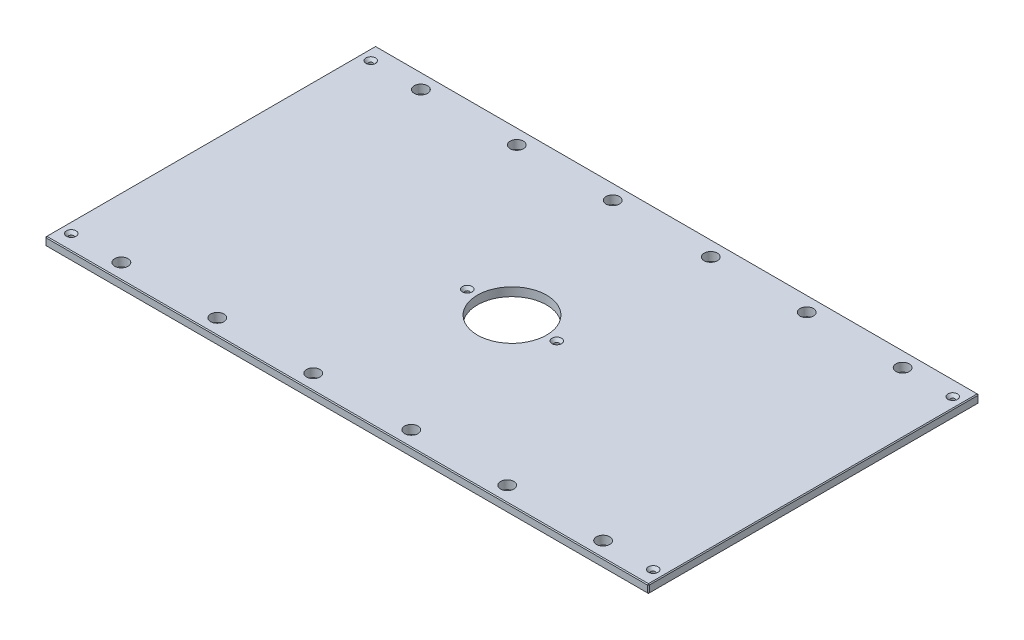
ISO-10303-21;
HEADER;
FILE_DESCRIPTION(('STEP AP214'),'2;1');
FILE_NAME('part.step','',(''),(''),'','','');
FILE_SCHEMA(('AUTOMOTIVE_DESIGN { 1 0 10303 214 1 1 1 1 }'));
ENDSEC;
DATA;
#1=APPLICATION_CONTEXT('core data for automotive mechanical design processes');
#2=APPLICATION_PROTOCOL_DEFINITION('international standard','automotive_design',2000,#1);
#3=PRODUCT_CONTEXT('',#1,'mechanical');
#4=PRODUCT('Part','Part','',(#3));
#5=PRODUCT_RELATED_PRODUCT_CATEGORY('part','',(#4));
#6=PRODUCT_DEFINITION_FORMATION('','',#4);
#7=PRODUCT_DEFINITION_CONTEXT('part definition',#1,'design');
#8=PRODUCT_DEFINITION('design','',#6,#7);
#9=PRODUCT_DEFINITION_SHAPE('','',#8);
#10=(LENGTH_UNIT() NAMED_UNIT(*) SI_UNIT(.MILLI.,.METRE.));
#11=(NAMED_UNIT(*) PLANE_ANGLE_UNIT() SI_UNIT($,.RADIAN.));
#12=(NAMED_UNIT(*) SI_UNIT($,.STERADIAN.) SOLID_ANGLE_UNIT());
#13=UNCERTAINTY_MEASURE_WITH_UNIT(LENGTH_MEASURE(1.E-05),#10,'distance_accuracy_value','');
#14=(GEOMETRIC_REPRESENTATION_CONTEXT(3) GLOBAL_UNCERTAINTY_ASSIGNED_CONTEXT((#13)) GLOBAL_UNIT_ASSIGNED_CONTEXT((#10,
#11,#12)) REPRESENTATION_CONTEXT('',''));
#15=CARTESIAN_POINT('',(0.,0.,0.));
#16=DIRECTION('',(0.,0.,1.));
#17=DIRECTION('',(1.,0.,0.));
#18=AXIS2_PLACEMENT_3D('',#15,#16,#17);
#19=CARTESIAN_POINT('',(-449.2625,12.7,-246.0625));
#20=DIRECTION('',(1.,0.,0.));
#21=DIRECTION('',(0.,0.,-1.));
#22=AXIS2_PLACEMENT_3D('',#19,#20,#21);
#23=PLANE('',#22);
#24=DIRECTION('',(0.,0.,-1.));
#25=VECTOR('',#24,1.);
#26=CARTESIAN_POINT('',(-449.2625,11.43,-246.0625));
#27=LINE('',#26,#25);
#28=CARTESIAN_POINT('',(-449.2625,11.43,244.7925));
#29=VERTEX_POINT('',#28);
#30=CARTESIAN_POINT('',(-449.2625,11.43,-244.7925));
#31=VERTEX_POINT('',#30);
#32=EDGE_CURVE('E135',#29,#31,#27,.T.);
#33=ORIENTED_EDGE('',*,*,#32,.T.);
#34=DIRECTION('',(0.,-1.,0.));
#35=VECTOR('',#34,1.);
#36=CARTESIAN_POINT('',(-449.2625,12.7,-244.7925));
#37=LINE('',#36,#35);
#38=CARTESIAN_POINT('',(-449.2625,1.26999999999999,-244.7925));
#39=VERTEX_POINT('',#38);
#40=EDGE_CURVE('E131',#31,#39,#37,.T.);
#41=ORIENTED_EDGE('',*,*,#40,.T.);
#42=DIRECTION('',(0.,0.,1.));
#43=VECTOR('',#42,1.);
#44=CARTESIAN_POINT('',(-449.2625,1.26999999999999,-246.0625));
#45=LINE('',#44,#43);
#46=CARTESIAN_POINT('',(-449.2625,1.26999999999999,244.7925));
#47=VERTEX_POINT('',#46);
#48=EDGE_CURVE('E126',#39,#47,#45,.T.);
#49=ORIENTED_EDGE('',*,*,#48,.T.);
#50=DIRECTION('',(0.,1.,0.));
#51=VECTOR('',#50,1.);
#52=CARTESIAN_POINT('',(-449.2625,12.7,244.7925));
#53=LINE('',#52,#51);
#54=EDGE_CURVE('E128',#47,#29,#53,.T.);
#55=ORIENTED_EDGE('',*,*,#54,.T.);
#56=EDGE_LOOP('',(#33,#41,#49,#55));
#57=FACE_BOUND('',#56,.T.);
#58=ADVANCED_FACE('F35',(#57),#23,.F.);
#59=CARTESIAN_POINT('',(-449.2625,12.7,246.0625));
#60=DIRECTION('',(0.,0.,-1.));
#61=DIRECTION('',(-1.,0.,0.));
#62=AXIS2_PLACEMENT_3D('',#59,#60,#61);
#63=PLANE('',#62);
#64=DIRECTION('',(1.,0.,0.));
#65=VECTOR('',#64,1.);
#66=CARTESIAN_POINT('',(-449.2625,1.2700000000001,246.0625));
#67=LINE('',#66,#65);
#68=CARTESIAN_POINT('',(-447.9925,1.2700000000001,246.0625));
#69=VERTEX_POINT('',#68);
#70=CARTESIAN_POINT('',(447.9925,1.2700000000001,246.0625));
#71=VERTEX_POINT('',#70);
#72=EDGE_CURVE('E58',#69,#71,#67,.T.);
#73=ORIENTED_EDGE('',*,*,#72,.T.);
#74=DIRECTION('',(0.,1.,0.));
#75=VECTOR('',#74,1.);
#76=CARTESIAN_POINT('',(447.9925,12.7,246.0625));
#77=LINE('',#76,#75);
#78=CARTESIAN_POINT('',(447.9925,11.4299999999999,246.0625));
#79=VERTEX_POINT('',#78);
#80=EDGE_CURVE('E11',#71,#79,#77,.T.);
#81=ORIENTED_EDGE('',*,*,#80,.T.);
#82=DIRECTION('',(-1.,0.,0.));
#83=VECTOR('',#82,1.);
#84=CARTESIAN_POINT('',(-449.2625,11.4299999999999,246.0625));
#85=LINE('',#84,#83);
#86=CARTESIAN_POINT('',(-447.9925,11.4299999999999,246.0625));
#87=VERTEX_POINT('',#86);
#88=EDGE_CURVE('E44',#79,#87,#85,.T.);
#89=ORIENTED_EDGE('',*,*,#88,.T.);
#90=DIRECTION('',(0.,-1.,0.));
#91=VECTOR('',#90,1.);
#92=CARTESIAN_POINT('',(-447.9925,12.7,246.0625));
#93=LINE('',#92,#91);
#94=EDGE_CURVE('E327',#87,#69,#93,.T.);
#95=ORIENTED_EDGE('',*,*,#94,.T.);
#96=EDGE_LOOP('',(#73,#81,#89,#95));
#97=FACE_BOUND('',#96,.T.);
#98=ADVANCED_FACE('F396',(#97),#63,.F.);
#99=CARTESIAN_POINT('',(449.2625,12.7,-246.0625));
#100=DIRECTION('',(-1.,0.,0.));
#101=DIRECTION('',(0.,0.,1.));
#102=AXIS2_PLACEMENT_3D('',#99,#100,#101);
#103=PLANE('',#102);
#104=DIRECTION('',(0.,0.,-1.));
#105=VECTOR('',#104,1.);
#106=CARTESIAN_POINT('',(449.2625,1.2700000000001,-246.0625));
#107=LINE('',#106,#105);
#108=CARTESIAN_POINT('',(449.2625,1.2700000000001,244.7925));
#109=VERTEX_POINT('',#108);
#110=CARTESIAN_POINT('',(449.2625,1.2700000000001,-244.7925));
#111=VERTEX_POINT('',#110);
#112=EDGE_CURVE('E322',#109,#111,#107,.T.);
#113=ORIENTED_EDGE('',*,*,#112,.T.);
#114=DIRECTION('',(0.,1.,0.));
#115=VECTOR('',#114,1.);
#116=CARTESIAN_POINT('',(449.2625,12.7,-244.7925));
#117=LINE('',#116,#115);
#118=CARTESIAN_POINT('',(449.2625,11.43,-244.7925));
#119=VERTEX_POINT('',#118);
#120=EDGE_CURVE('E324',#111,#119,#117,.T.);
#121=ORIENTED_EDGE('',*,*,#120,.T.);
#122=DIRECTION('',(0.,0.,1.));
#123=VECTOR('',#122,1.);
#124=CARTESIAN_POINT('',(449.2625,11.43,246.0625));
#125=LINE('',#124,#123);
#126=CARTESIAN_POINT('',(449.2625,11.43,244.7925));
#127=VERTEX_POINT('',#126);
#128=EDGE_CURVE('E320',#119,#127,#125,.T.);
#129=ORIENTED_EDGE('',*,*,#128,.T.);
#130=DIRECTION('',(0.,-1.,0.));
#131=VECTOR('',#130,1.);
#132=CARTESIAN_POINT('',(449.2625,12.7,244.7925));
#133=LINE('',#132,#131);
#134=EDGE_CURVE('E318',#127,#109,#133,.T.);
#135=ORIENTED_EDGE('',*,*,#134,.T.);
#136=EDGE_LOOP('',(#113,#121,#129,#135));
#137=FACE_BOUND('',#136,.T.);
#138=ADVANCED_FACE('F383',(#137),#103,.F.);
#139=CARTESIAN_POINT('',(-449.2625,12.7,-246.0625));
#140=DIRECTION('',(0.,0.,1.));
#141=DIRECTION('',(1.,0.,0.));
#142=AXIS2_PLACEMENT_3D('',#139,#140,#141);
#143=PLANE('',#142);
#144=DIRECTION('',(-1.,0.,0.));
#145=VECTOR('',#144,1.);
#146=CARTESIAN_POINT('',(-449.2625,1.2700000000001,-246.0625));
#147=LINE('',#146,#145);
#148=CARTESIAN_POINT('',(447.9925,1.2700000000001,-246.0625));
#149=VERTEX_POINT('',#148);
#150=CARTESIAN_POINT('',(-447.9925,1.2700000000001,-246.0625));
#151=VERTEX_POINT('',#150);
#152=EDGE_CURVE('E294',#149,#151,#147,.T.);
#153=ORIENTED_EDGE('',*,*,#152,.T.);
#154=DIRECTION('',(0.,1.,0.));
#155=VECTOR('',#154,1.);
#156=CARTESIAN_POINT('',(-447.9925,12.7,-246.0625));
#157=LINE('',#156,#155);
#158=CARTESIAN_POINT('',(-447.9925,11.43,-246.0625));
#159=VERTEX_POINT('',#158);
#160=EDGE_CURVE('E298',#151,#159,#157,.T.);
#161=ORIENTED_EDGE('',*,*,#160,.T.);
#162=DIRECTION('',(1.,0.,0.));
#163=VECTOR('',#162,1.);
#164=CARTESIAN_POINT('',(449.2625,11.43,-246.0625));
#165=LINE('',#164,#163);
#166=CARTESIAN_POINT('',(447.9925,11.43,-246.0625));
#167=VERTEX_POINT('',#166);
#168=EDGE_CURVE('E296',#159,#167,#165,.T.);
#169=ORIENTED_EDGE('',*,*,#168,.T.);
#170=DIRECTION('',(0.,-1.,0.));
#171=VECTOR('',#170,1.);
#172=CARTESIAN_POINT('',(447.9925,12.7,-246.0625));
#173=LINE('',#172,#171);
#174=EDGE_CURVE('E292',#167,#149,#173,.T.);
#175=ORIENTED_EDGE('',*,*,#174,.T.);
#176=EDGE_LOOP('',(#153,#161,#169,#175));
#177=FACE_BOUND('',#176,.T.);
#178=ADVANCED_FACE('F357',(#177),#143,.F.);
#179=CARTESIAN_POINT('',(0.,12.7,0.));
#180=DIRECTION('',(0.,1.,0.));
#181=DIRECTION('',(0.,0.,1.));
#182=AXIS2_PLACEMENT_3D('',#179,#180,#181);
#183=PLANE('',#182);
#184=CARTESIAN_POINT('',(433.3875,12.7,-223.04248));
#185=DIRECTION('',(0.,1.,0.));
#186=DIRECTION('',(0.,0.,1.));
#187=AXIS2_PLACEMENT_3D('',#184,#185,#186);
#188=CIRCLE('',#187,7.13740000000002);
#189=CARTESIAN_POINT('',(433.3875,12.7,-215.90508));
#190=VERTEX_POINT('',#189);
#191=EDGE_CURVE('E880',#190,#190,#188,.T.);
#192=ORIENTED_EDGE('',*,*,#191,.F.);
#193=EDGE_LOOP('',(#192));
#194=FACE_BOUND('',#193,.T.);
#195=CARTESIAN_POINT('',(433.3875,12.7,223.04248));
#196=DIRECTION('',(0.,1.,0.));
#197=DIRECTION('',(0.,0.,1.));
#198=AXIS2_PLACEMENT_3D('',#195,#196,#197);
#199=CIRCLE('',#198,7.13740000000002);
#200=CARTESIAN_POINT('',(433.3875,12.7,230.17988));
#201=VERTEX_POINT('',#200);
#202=EDGE_CURVE('E884',#201,#201,#199,.T.);
#203=ORIENTED_EDGE('',*,*,#202,.F.);
#204=EDGE_LOOP('',(#203));
#205=FACE_BOUND('',#204,.T.);
#206=CARTESIAN_POINT('',(-433.3875,12.7,223.04248));
#207=DIRECTION('',(0.,1.,0.));
#208=DIRECTION('',(0.,0.,1.));
#209=AXIS2_PLACEMENT_3D('',#206,#207,#208);
#210=CIRCLE('',#209,7.13740000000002);
#211=CARTESIAN_POINT('',(-433.3875,12.7,230.17988));
#212=VERTEX_POINT('',#211);
#213=EDGE_CURVE('E888',#212,#212,#210,.T.);
#214=ORIENTED_EDGE('',*,*,#213,.F.);
#215=EDGE_LOOP('',(#214));
#216=FACE_BOUND('',#215,.T.);
#217=CARTESIAN_POINT('',(-66.675,12.7,0.));
#218=DIRECTION('',(0.,1.,0.));
#219=DIRECTION('',(0.,0.,1.));
#220=AXIS2_PLACEMENT_3D('',#217,#218,#219);
#221=CIRCLE('',#220,7.1374);
#222=CARTESIAN_POINT('',(-66.675,12.7,7.1374));
#223=VERTEX_POINT('',#222);
#224=EDGE_CURVE('E892',#223,#223,#221,.T.);
#225=ORIENTED_EDGE('',*,*,#224,.F.);
#226=EDGE_LOOP('',(#225));
#227=FACE_BOUND('',#226,.T.);
#228=CARTESIAN_POINT('',(66.675,12.7,0.));
#229=DIRECTION('',(0.,1.,0.));
#230=DIRECTION('',(0.,0.,1.));
#231=AXIS2_PLACEMENT_3D('',#228,#229,#230);
#232=CIRCLE('',#231,7.1374);
#233=CARTESIAN_POINT('',(66.675,12.7,7.1374));
#234=VERTEX_POINT('',#233);
#235=EDGE_CURVE('E896',#234,#234,#232,.T.);
#236=ORIENTED_EDGE('',*,*,#235,.F.);
#237=EDGE_LOOP('',(#236));
#238=FACE_BOUND('',#237,.T.);
#239=CARTESIAN_POINT('',(-433.3875,12.7,-223.04248));
#240=DIRECTION('',(0.,1.,0.));
#241=DIRECTION('',(0.,0.,1.));
#242=AXIS2_PLACEMENT_3D('',#239,#240,#241);
#243=CIRCLE('',#242,7.13740000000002);
#244=CARTESIAN_POINT('',(-433.3875,12.7,-215.90508));
#245=VERTEX_POINT('',#244);
#246=EDGE_CURVE('E899',#245,#245,#243,.T.);
#247=ORIENTED_EDGE('',*,*,#246,.F.);
#248=EDGE_LOOP('',(#247));
#249=FACE_BOUND('',#248,.T.);
#250=DIRECTION('',(0.,0.,-1.));
#251=VECTOR('',#250,1.);
#252=CARTESIAN_POINT('',(447.9925,12.7,-246.0625));
#253=LINE('',#252,#251);
#254=CARTESIAN_POINT('',(447.9925,12.7,244.7925));
#255=VERTEX_POINT('',#254);
#256=CARTESIAN_POINT('',(447.9925,12.7,-244.7925));
#257=VERTEX_POINT('',#256);
#258=EDGE_CURVE('E305',#255,#257,#253,.T.);
#259=ORIENTED_EDGE('',*,*,#258,.T.);
#260=DIRECTION('',(-1.,0.,0.));
#261=VECTOR('',#260,1.);
#262=CARTESIAN_POINT('',(-449.2625,12.7,-244.7925));
#263=LINE('',#262,#261);
#264=CARTESIAN_POINT('',(-447.9925,12.7,-244.7925));
#265=VERTEX_POINT('',#264);
#266=EDGE_CURVE('E307',#257,#265,#263,.T.);
#267=ORIENTED_EDGE('',*,*,#266,.T.);
#268=DIRECTION('',(0.,0.,1.));
#269=VECTOR('',#268,1.);
#270=CARTESIAN_POINT('',(-447.9925,12.7,246.0625));
#271=LINE('',#270,#269);
#272=CARTESIAN_POINT('',(-447.9925,12.7,244.7925));
#273=VERTEX_POINT('',#272);
#274=EDGE_CURVE('E303',#265,#273,#271,.T.);
#275=ORIENTED_EDGE('',*,*,#274,.T.);
#276=DIRECTION('',(1.,0.,0.));
#277=VECTOR('',#276,1.);
#278=CARTESIAN_POINT('',(449.2625,12.7,244.7925));
#279=LINE('',#278,#277);
#280=EDGE_CURVE('E301',#273,#255,#279,.T.);
#281=ORIENTED_EDGE('',*,*,#280,.T.);
#282=EDGE_LOOP('',(#259,#267,#275,#281));
#283=FACE_BOUND('',#282,.T.);
#284=CARTESIAN_POINT('',(358.775,12.7,-223.04248));
#285=DIRECTION('',(0.,1.,0.));
#286=DIRECTION('',(0.,0.,1.));
#287=AXIS2_PLACEMENT_3D('',#284,#285,#286);
#288=CIRCLE('',#287,9.92187500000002);
#289=CARTESIAN_POINT('',(358.775,12.7,-213.120605));
#290=VERTEX_POINT('',#289);
#291=EDGE_CURVE('E204',#290,#290,#288,.T.);
#292=ORIENTED_EDGE('',*,*,#291,.F.);
#293=EDGE_LOOP('',(#292));
#294=FACE_BOUND('',#293,.T.);
#295=CARTESIAN_POINT('',(-358.775,12.7,-223.04248));
#296=DIRECTION('',(0.,1.,0.));
#297=DIRECTION('',(0.,0.,1.));
#298=AXIS2_PLACEMENT_3D('',#295,#296,#297);
#299=CIRCLE('',#298,9.92187500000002);
#300=CARTESIAN_POINT('',(-358.775,12.7,-213.120605));
#301=VERTEX_POINT('',#300);
#302=EDGE_CURVE('E214',#301,#301,#299,.T.);
#303=ORIENTED_EDGE('',*,*,#302,.F.);
#304=EDGE_LOOP('',(#303));
#305=FACE_BOUND('',#304,.T.);
#306=CARTESIAN_POINT('',(358.775,12.7,223.04248));
#307=DIRECTION('',(0.,1.,0.));
#308=DIRECTION('',(0.,0.,1.));
#309=AXIS2_PLACEMENT_3D('',#306,#307,#308);
#310=CIRCLE('',#309,9.92187500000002);
#311=CARTESIAN_POINT('',(358.775,12.7,232.964355));
#312=VERTEX_POINT('',#311);
#313=EDGE_CURVE('E225',#312,#312,#310,.T.);
#314=ORIENTED_EDGE('',*,*,#313,.F.);
#315=EDGE_LOOP('',(#314));
#316=FACE_BOUND('',#315,.T.);
#317=CARTESIAN_POINT('',(-358.775,12.7,223.04248));
#318=DIRECTION('',(0.,1.,0.));
#319=DIRECTION('',(0.,0.,1.));
#320=AXIS2_PLACEMENT_3D('',#317,#318,#319);
#321=CIRCLE('',#320,9.92187500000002);
#322=CARTESIAN_POINT('',(-358.775,12.7,232.964355));
#323=VERTEX_POINT('',#322);
#324=EDGE_CURVE('E231',#323,#323,#321,.T.);
#325=ORIENTED_EDGE('',*,*,#324,.F.);
#326=EDGE_LOOP('',(#325));
#327=FACE_BOUND('',#326,.T.);
#328=CARTESIAN_POINT('',(-215.9,12.7,-223.04248));
#329=DIRECTION('',(0.,1.,0.));
#330=DIRECTION('',(0.,0.,1.));
#331=AXIS2_PLACEMENT_3D('',#328,#329,#330);
#332=CIRCLE('',#331,9.921875);
#333=CARTESIAN_POINT('',(-215.9,12.7,-213.120605));
#334=VERTEX_POINT('',#333);
#335=EDGE_CURVE('E237',#334,#334,#332,.T.);
#336=ORIENTED_EDGE('',*,*,#335,.F.);
#337=EDGE_LOOP('',(#336));
#338=FACE_BOUND('',#337,.T.);
#339=CARTESIAN_POINT('',(215.9,12.7,-223.04248));
#340=DIRECTION('',(0.,1.,0.));
#341=DIRECTION('',(0.,0.,1.));
#342=AXIS2_PLACEMENT_3D('',#339,#340,#341);
#343=CIRCLE('',#342,9.921875);
#344=CARTESIAN_POINT('',(215.9,12.7,-213.120605));
#345=VERTEX_POINT('',#344);
#346=EDGE_CURVE('E243',#345,#345,#343,.T.);
#347=ORIENTED_EDGE('',*,*,#346,.F.);
#348=EDGE_LOOP('',(#347));
#349=FACE_BOUND('',#348,.T.);
#350=CARTESIAN_POINT('',(215.9,12.7,223.04248));
#351=DIRECTION('',(0.,1.,0.));
#352=DIRECTION('',(0.,0.,1.));
#353=AXIS2_PLACEMENT_3D('',#350,#351,#352);
#354=CIRCLE('',#353,9.921875);
#355=CARTESIAN_POINT('',(215.9,12.7,232.964355));
#356=VERTEX_POINT('',#355);
#357=EDGE_CURVE('E249',#356,#356,#354,.T.);
#358=ORIENTED_EDGE('',*,*,#357,.F.);
#359=EDGE_LOOP('',(#358));
#360=FACE_BOUND('',#359,.T.);
#361=CARTESIAN_POINT('',(-215.9,12.7,223.04248));
#362=DIRECTION('',(0.,1.,0.));
#363=DIRECTION('',(0.,0.,1.));
#364=AXIS2_PLACEMENT_3D('',#361,#362,#363);
#365=CIRCLE('',#364,9.921875);
#366=CARTESIAN_POINT('',(-215.9,12.7,232.964355));
#367=VERTEX_POINT('',#366);
#368=EDGE_CURVE('E255',#367,#367,#365,.T.);
#369=ORIENTED_EDGE('',*,*,#368,.F.);
#370=EDGE_LOOP('',(#369));
#371=FACE_BOUND('',#370,.T.);
#372=CARTESIAN_POINT('',(73.025,12.7,-223.04248));
#373=DIRECTION('',(0.,1.,0.));
#374=DIRECTION('',(0.,0.,1.));
#375=AXIS2_PLACEMENT_3D('',#372,#373,#374);
#376=CIRCLE('',#375,9.921875);
#377=CARTESIAN_POINT('',(73.025,12.7,-213.120605));
#378=VERTEX_POINT('',#377);
#379=EDGE_CURVE('E261',#378,#378,#376,.T.);
#380=ORIENTED_EDGE('',*,*,#379,.F.);
#381=EDGE_LOOP('',(#380));
#382=FACE_BOUND('',#381,.T.);
#383=CARTESIAN_POINT('',(-73.025,12.7,-223.04248));
#384=DIRECTION('',(0.,1.,0.));
#385=DIRECTION('',(0.,0.,1.));
#386=AXIS2_PLACEMENT_3D('',#383,#384,#385);
#387=CIRCLE('',#386,9.921875);
#388=CARTESIAN_POINT('',(-73.025,12.7,-213.120605));
#389=VERTEX_POINT('',#388);
#390=EDGE_CURVE('E267',#389,#389,#387,.T.);
#391=ORIENTED_EDGE('',*,*,#390,.F.);
#392=EDGE_LOOP('',(#391));
#393=FACE_BOUND('',#392,.T.);
#394=CARTESIAN_POINT('',(-73.025,12.7,223.04248));
#395=DIRECTION('',(0.,1.,0.));
#396=DIRECTION('',(0.,0.,1.));
#397=AXIS2_PLACEMENT_3D('',#394,#395,#396);
#398=CIRCLE('',#397,9.921875);
#399=CARTESIAN_POINT('',(-73.025,12.7,232.964355));
#400=VERTEX_POINT('',#399);
#401=EDGE_CURVE('E273',#400,#400,#398,.T.);
#402=ORIENTED_EDGE('',*,*,#401,.F.);
#403=EDGE_LOOP('',(#402));
#404=FACE_BOUND('',#403,.T.);
#405=CARTESIAN_POINT('',(73.025,12.7,223.04248));
#406=DIRECTION('',(0.,1.,0.));
#407=DIRECTION('',(0.,0.,1.));
#408=AXIS2_PLACEMENT_3D('',#405,#406,#407);
#409=CIRCLE('',#408,9.921875);
#410=CARTESIAN_POINT('',(73.025,12.7,232.964355));
#411=VERTEX_POINT('',#410);
#412=EDGE_CURVE('E279',#411,#411,#409,.T.);
#413=ORIENTED_EDGE('',*,*,#412,.F.);
#414=EDGE_LOOP('',(#413));
#415=FACE_BOUND('',#414,.T.);
#416=CARTESIAN_POINT('',(0.,12.7,0.));
#417=DIRECTION('',(0.,1.,0.));
#418=DIRECTION('',(0.,0.,1.));
#419=AXIS2_PLACEMENT_3D('',#416,#417,#418);
#420=CIRCLE('',#419,51.562);
#421=CARTESIAN_POINT('',(0.,12.7,51.562));
#422=VERTEX_POINT('',#421);
#423=EDGE_CURVE('E285',#422,#422,#420,.T.);
#424=ORIENTED_EDGE('',*,*,#423,.F.);
#425=EDGE_LOOP('',(#424));
#426=FACE_BOUND('',#425,.T.);
#427=ADVANCED_FACE('F405',(#194,#205,#216,#227,#238,#249,#283,#294,#305,#316,#327,#338,#349,
#360,#371,#382,#393,#404,#415,#426),#183,.T.);
#428=CARTESIAN_POINT('',(0.,0.,0.));
#429=DIRECTION('',(0.,1.,0.));
#430=DIRECTION('',(0.,0.,1.));
#431=AXIS2_PLACEMENT_3D('',#428,#429,#430);
#432=PLANE('',#431);
#433=CARTESIAN_POINT('',(433.3875,0.,-223.04248));
#434=DIRECTION('',(0.,1.,0.));
#435=DIRECTION('',(0.,0.,1.));
#436=AXIS2_PLACEMENT_3D('',#433,#434,#435);
#437=CIRCLE('',#436,3.3782);
#438=CARTESIAN_POINT('',(433.3875,0.,-219.66428));
#439=VERTEX_POINT('',#438);
#440=EDGE_CURVE('E933',#439,#439,#437,.T.);
#441=ORIENTED_EDGE('',*,*,#440,.T.);
#442=EDGE_LOOP('',(#441));
#443=FACE_BOUND('',#442,.T.);
#444=CARTESIAN_POINT('',(433.3875,0.,223.04248));
#445=DIRECTION('',(0.,1.,0.));
#446=DIRECTION('',(0.,0.,1.));
#447=AXIS2_PLACEMENT_3D('',#444,#445,#446);
#448=CIRCLE('',#447,3.3782);
#449=CARTESIAN_POINT('',(433.3875,0.,226.42068));
#450=VERTEX_POINT('',#449);
#451=EDGE_CURVE('E926',#450,#450,#448,.T.);
#452=ORIENTED_EDGE('',*,*,#451,.T.);
#453=EDGE_LOOP('',(#452));
#454=FACE_BOUND('',#453,.T.);
#455=CARTESIAN_POINT('',(-433.3875,0.,223.04248));
#456=DIRECTION('',(0.,1.,0.));
#457=DIRECTION('',(0.,0.,1.));
#458=AXIS2_PLACEMENT_3D('',#455,#456,#457);
#459=CIRCLE('',#458,3.3782);
#460=CARTESIAN_POINT('',(-433.3875,0.,226.42068));
#461=VERTEX_POINT('',#460);
#462=EDGE_CURVE('E919',#461,#461,#459,.T.);
#463=ORIENTED_EDGE('',*,*,#462,.T.);
#464=EDGE_LOOP('',(#463));
#465=FACE_BOUND('',#464,.T.);
#466=CARTESIAN_POINT('',(-66.675,0.,0.));
#467=DIRECTION('',(0.,1.,0.));
#468=DIRECTION('',(0.,0.,1.));
#469=AXIS2_PLACEMENT_3D('',#466,#467,#468);
#470=CIRCLE('',#469,3.3782);
#471=CARTESIAN_POINT('',(-66.675,0.,3.3782));
#472=VERTEX_POINT('',#471);
#473=EDGE_CURVE('E912',#472,#472,#470,.T.);
#474=ORIENTED_EDGE('',*,*,#473,.T.);
#475=EDGE_LOOP('',(#474));
#476=FACE_BOUND('',#475,.T.);
#477=CARTESIAN_POINT('',(66.675,0.,0.));
#478=DIRECTION('',(0.,1.,0.));
#479=DIRECTION('',(0.,0.,1.));
#480=AXIS2_PLACEMENT_3D('',#477,#478,#479);
#481=CIRCLE('',#480,3.3782);
#482=CARTESIAN_POINT('',(66.675,0.,3.3782));
#483=VERTEX_POINT('',#482);
#484=EDGE_CURVE('E902',#483,#483,#481,.T.);
#485=ORIENTED_EDGE('',*,*,#484,.T.);
#486=EDGE_LOOP('',(#485));
#487=FACE_BOUND('',#486,.T.);
#488=CARTESIAN_POINT('',(-433.3875,0.,-223.04248));
#489=DIRECTION('',(0.,1.,0.));
#490=DIRECTION('',(0.,0.,1.));
#491=AXIS2_PLACEMENT_3D('',#488,#489,#490);
#492=CIRCLE('',#491,3.3782);
#493=CARTESIAN_POINT('',(-433.3875,0.,-219.66428));
#494=VERTEX_POINT('',#493);
#495=EDGE_CURVE('E217',#494,#494,#492,.T.);
#496=ORIENTED_EDGE('',*,*,#495,.T.);
#497=EDGE_LOOP('',(#496));
#498=FACE_BOUND('',#497,.T.);
#499=DIRECTION('',(0.,0.,-1.));
#500=VECTOR('',#499,1.);
#501=CARTESIAN_POINT('',(-447.9925,0.,0.));
#502=LINE('',#501,#500);
#503=CARTESIAN_POINT('',(-447.9925,0.,244.7925));
#504=VERTEX_POINT('',#503);
#505=CARTESIAN_POINT('',(-447.9925,0.,-244.7925));
#506=VERTEX_POINT('',#505);
#507=EDGE_CURVE('E158',#504,#506,#502,.T.);
#508=ORIENTED_EDGE('',*,*,#507,.T.);
#509=DIRECTION('',(1.,0.,0.));
#510=VECTOR('',#509,1.);
#511=CARTESIAN_POINT('',(0.,0.,-244.7925));
#512=LINE('',#511,#510);
#513=CARTESIAN_POINT('',(447.9925,0.,-244.7925));
#514=VERTEX_POINT('',#513);
#515=EDGE_CURVE('E315',#506,#514,#512,.T.);
#516=ORIENTED_EDGE('',*,*,#515,.T.);
#517=DIRECTION('',(0.,0.,1.));
#518=VECTOR('',#517,1.);
#519=CARTESIAN_POINT('',(447.9925,0.,0.));
#520=LINE('',#519,#518);
#521=CARTESIAN_POINT('',(447.9925,0.,244.7925));
#522=VERTEX_POINT('',#521);
#523=EDGE_CURVE('E313',#514,#522,#520,.T.);
#524=ORIENTED_EDGE('',*,*,#523,.T.);
#525=DIRECTION('',(-1.,0.,0.));
#526=VECTOR('',#525,1.);
#527=CARTESIAN_POINT('',(0.,0.,244.7925));
#528=LINE('',#527,#526);
#529=EDGE_CURVE('E310',#522,#504,#528,.T.);
#530=ORIENTED_EDGE('',*,*,#529,.T.);
#531=EDGE_LOOP('',(#508,#516,#524,#530));
#532=FACE_BOUND('',#531,.T.);
#533=CARTESIAN_POINT('',(358.775,0.,-223.04248));
#534=DIRECTION('',(0.,1.,0.));
#535=DIRECTION('',(0.,0.,1.));
#536=AXIS2_PLACEMENT_3D('',#533,#534,#535);
#537=CIRCLE('',#536,9.92187500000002);
#538=CARTESIAN_POINT('',(358.775,0.,-213.120605));
#539=VERTEX_POINT('',#538);
#540=EDGE_CURVE('E209',#539,#539,#537,.T.);
#541=ORIENTED_EDGE('',*,*,#540,.T.);
#542=EDGE_LOOP('',(#541));
#543=FACE_BOUND('',#542,.T.);
#544=CARTESIAN_POINT('',(-358.775,0.,-223.04248));
#545=DIRECTION('',(0.,1.,0.));
#546=DIRECTION('',(0.,0.,1.));
#547=AXIS2_PLACEMENT_3D('',#544,#545,#546);
#548=CIRCLE('',#547,9.92187500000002);
#549=CARTESIAN_POINT('',(-358.775,0.,-213.120605));
#550=VERTEX_POINT('',#549);
#551=EDGE_CURVE('E222',#550,#550,#548,.T.);
#552=ORIENTED_EDGE('',*,*,#551,.T.);
#553=EDGE_LOOP('',(#552));
#554=FACE_BOUND('',#553,.T.);
#555=CARTESIAN_POINT('',(358.775,0.,223.04248));
#556=DIRECTION('',(0.,1.,0.));
#557=DIRECTION('',(0.,0.,1.));
#558=AXIS2_PLACEMENT_3D('',#555,#556,#557);
#559=CIRCLE('',#558,9.92187500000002);
#560=CARTESIAN_POINT('',(358.775,0.,232.964355));
#561=VERTEX_POINT('',#560);
#562=EDGE_CURVE('E228',#561,#561,#559,.T.);
#563=ORIENTED_EDGE('',*,*,#562,.T.);
#564=EDGE_LOOP('',(#563));
#565=FACE_BOUND('',#564,.T.);
#566=CARTESIAN_POINT('',(-358.775,0.,223.04248));
#567=DIRECTION('',(0.,1.,0.));
#568=DIRECTION('',(0.,0.,1.));
#569=AXIS2_PLACEMENT_3D('',#566,#567,#568);
#570=CIRCLE('',#569,9.92187500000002);
#571=CARTESIAN_POINT('',(-358.775,0.,232.964355));
#572=VERTEX_POINT('',#571);
#573=EDGE_CURVE('E234',#572,#572,#570,.T.);
#574=ORIENTED_EDGE('',*,*,#573,.T.);
#575=EDGE_LOOP('',(#574));
#576=FACE_BOUND('',#575,.T.);
#577=CARTESIAN_POINT('',(-215.9,0.,-223.04248));
#578=DIRECTION('',(0.,1.,0.));
#579=DIRECTION('',(0.,0.,1.));
#580=AXIS2_PLACEMENT_3D('',#577,#578,#579);
#581=CIRCLE('',#580,9.921875);
#582=CARTESIAN_POINT('',(-215.9,0.,-213.120605));
#583=VERTEX_POINT('',#582);
#584=EDGE_CURVE('E240',#583,#583,#581,.T.);
#585=ORIENTED_EDGE('',*,*,#584,.T.);
#586=EDGE_LOOP('',(#585));
#587=FACE_BOUND('',#586,.T.);
#588=CARTESIAN_POINT('',(215.9,0.,-223.04248));
#589=DIRECTION('',(0.,1.,0.));
#590=DIRECTION('',(0.,0.,1.));
#591=AXIS2_PLACEMENT_3D('',#588,#589,#590);
#592=CIRCLE('',#591,9.921875);
#593=CARTESIAN_POINT('',(215.9,0.,-213.120605));
#594=VERTEX_POINT('',#593);
#595=EDGE_CURVE('E246',#594,#594,#592,.T.);
#596=ORIENTED_EDGE('',*,*,#595,.T.);
#597=EDGE_LOOP('',(#596));
#598=FACE_BOUND('',#597,.T.);
#599=CARTESIAN_POINT('',(215.9,0.,223.04248));
#600=DIRECTION('',(0.,1.,0.));
#601=DIRECTION('',(0.,0.,1.));
#602=AXIS2_PLACEMENT_3D('',#599,#600,#601);
#603=CIRCLE('',#602,9.921875);
#604=CARTESIAN_POINT('',(215.9,0.,232.964355));
#605=VERTEX_POINT('',#604);
#606=EDGE_CURVE('E252',#605,#605,#603,.T.);
#607=ORIENTED_EDGE('',*,*,#606,.T.);
#608=EDGE_LOOP('',(#607));
#609=FACE_BOUND('',#608,.T.);
#610=CARTESIAN_POINT('',(-215.9,0.,223.04248));
#611=DIRECTION('',(0.,1.,0.));
#612=DIRECTION('',(0.,0.,1.));
#613=AXIS2_PLACEMENT_3D('',#610,#611,#612);
#614=CIRCLE('',#613,9.921875);
#615=CARTESIAN_POINT('',(-215.9,0.,232.964355));
#616=VERTEX_POINT('',#615);
#617=EDGE_CURVE('E258',#616,#616,#614,.T.);
#618=ORIENTED_EDGE('',*,*,#617,.T.);
#619=EDGE_LOOP('',(#618));
#620=FACE_BOUND('',#619,.T.);
#621=CARTESIAN_POINT('',(73.025,0.,-223.04248));
#622=DIRECTION('',(0.,1.,0.));
#623=DIRECTION('',(0.,0.,1.));
#624=AXIS2_PLACEMENT_3D('',#621,#622,#623);
#625=CIRCLE('',#624,9.921875);
#626=CARTESIAN_POINT('',(73.025,0.,-213.120605));
#627=VERTEX_POINT('',#626);
#628=EDGE_CURVE('E264',#627,#627,#625,.T.);
#629=ORIENTED_EDGE('',*,*,#628,.T.);
#630=EDGE_LOOP('',(#629));
#631=FACE_BOUND('',#630,.T.);
#632=CARTESIAN_POINT('',(-73.025,0.,-223.04248));
#633=DIRECTION('',(0.,1.,0.));
#634=DIRECTION('',(0.,0.,1.));
#635=AXIS2_PLACEMENT_3D('',#632,#633,#634);
#636=CIRCLE('',#635,9.921875);
#637=CARTESIAN_POINT('',(-73.025,0.,-213.120605));
#638=VERTEX_POINT('',#637);
#639=EDGE_CURVE('E270',#638,#638,#636,.T.);
#640=ORIENTED_EDGE('',*,*,#639,.T.);
#641=EDGE_LOOP('',(#640));
#642=FACE_BOUND('',#641,.T.);
#643=CARTESIAN_POINT('',(-73.025,0.,223.04248));
#644=DIRECTION('',(0.,1.,0.));
#645=DIRECTION('',(0.,0.,1.));
#646=AXIS2_PLACEMENT_3D('',#643,#644,#645);
#647=CIRCLE('',#646,9.921875);
#648=CARTESIAN_POINT('',(-73.025,0.,232.964355));
#649=VERTEX_POINT('',#648);
#650=EDGE_CURVE('E276',#649,#649,#647,.T.);
#651=ORIENTED_EDGE('',*,*,#650,.T.);
#652=EDGE_LOOP('',(#651));
#653=FACE_BOUND('',#652,.T.);
#654=CARTESIAN_POINT('',(73.025,0.,223.04248));
#655=DIRECTION('',(0.,1.,0.));
#656=DIRECTION('',(0.,0.,1.));
#657=AXIS2_PLACEMENT_3D('',#654,#655,#656);
#658=CIRCLE('',#657,9.921875);
#659=CARTESIAN_POINT('',(73.025,0.,232.964355));
#660=VERTEX_POINT('',#659);
#661=EDGE_CURVE('E282',#660,#660,#658,.T.);
#662=ORIENTED_EDGE('',*,*,#661,.T.);
#663=EDGE_LOOP('',(#662));
#664=FACE_BOUND('',#663,.T.);
#665=CARTESIAN_POINT('',(0.,0.,0.));
#666=DIRECTION('',(0.,1.,0.));
#667=DIRECTION('',(0.,0.,1.));
#668=AXIS2_PLACEMENT_3D('',#665,#666,#667);
#669=CIRCLE('',#668,51.562);
#670=CARTESIAN_POINT('',(0.,0.,51.562));
#671=VERTEX_POINT('',#670);
#672=EDGE_CURVE('E147',#671,#671,#669,.T.);
#673=ORIENTED_EDGE('',*,*,#672,.T.);
#674=EDGE_LOOP('',(#673));
#675=FACE_BOUND('',#674,.T.);
#676=ADVANCED_FACE('F370',(#443,#454,#465,#476,#487,#498,#532,#543,#554,#565,#576,#587,#598,
#609,#620,#631,#642,#653,#664,#675),#432,.F.);
#677=CARTESIAN_POINT('',(0.,0.,0.));
#678=DIRECTION('',(0.,1.,0.));
#679=DIRECTION('',(0.,0.,1.));
#680=AXIS2_PLACEMENT_3D('',#677,#678,#679);
#681=CYLINDRICAL_SURFACE('',#680,51.562);
#682=ORIENTED_EDGE('',*,*,#672,.F.);
#683=EDGE_LOOP('',(#682));
#684=FACE_BOUND('',#683,.T.);
#685=ORIENTED_EDGE('',*,*,#423,.T.);
#686=EDGE_LOOP('',(#685));
#687=FACE_BOUND('',#686,.T.);
#688=ADVANCED_FACE('F811',(#684,#687),#681,.F.);
#689=CARTESIAN_POINT('',(73.025,12.7,223.04248));
#690=DIRECTION('',(0.,1.,0.));
#691=DIRECTION('',(0.,0.,1.));
#692=AXIS2_PLACEMENT_3D('',#689,#690,#691);
#693=CYLINDRICAL_SURFACE('',#692,9.921875);
#694=ORIENTED_EDGE('',*,*,#661,.F.);
#695=EDGE_LOOP('',(#694));
#696=FACE_BOUND('',#695,.T.);
#697=ORIENTED_EDGE('',*,*,#412,.T.);
#698=EDGE_LOOP('',(#697));
#699=FACE_BOUND('',#698,.T.);
#700=ADVANCED_FACE('F802',(#696,#699),#693,.F.);
#701=CARTESIAN_POINT('',(-73.025,12.7,223.04248));
#702=DIRECTION('',(0.,1.,0.));
#703=DIRECTION('',(0.,0.,1.));
#704=AXIS2_PLACEMENT_3D('',#701,#702,#703);
#705=CYLINDRICAL_SURFACE('',#704,9.921875);
#706=ORIENTED_EDGE('',*,*,#650,.F.);
#707=EDGE_LOOP('',(#706));
#708=FACE_BOUND('',#707,.T.);
#709=ORIENTED_EDGE('',*,*,#401,.T.);
#710=EDGE_LOOP('',(#709));
#711=FACE_BOUND('',#710,.T.);
#712=ADVANCED_FACE('F793',(#708,#711),#705,.F.);
#713=CARTESIAN_POINT('',(-73.025,12.7,-223.04248));
#714=DIRECTION('',(0.,1.,0.));
#715=DIRECTION('',(0.,0.,1.));
#716=AXIS2_PLACEMENT_3D('',#713,#714,#715);
#717=CYLINDRICAL_SURFACE('',#716,9.921875);
#718=ORIENTED_EDGE('',*,*,#639,.F.);
#719=EDGE_LOOP('',(#718));
#720=FACE_BOUND('',#719,.T.);
#721=ORIENTED_EDGE('',*,*,#390,.T.);
#722=EDGE_LOOP('',(#721));
#723=FACE_BOUND('',#722,.T.);
#724=ADVANCED_FACE('F784',(#720,#723),#717,.F.);
#725=CARTESIAN_POINT('',(73.025,12.7,-223.04248));
#726=DIRECTION('',(0.,1.,0.));
#727=DIRECTION('',(0.,0.,1.));
#728=AXIS2_PLACEMENT_3D('',#725,#726,#727);
#729=CYLINDRICAL_SURFACE('',#728,9.921875);
#730=ORIENTED_EDGE('',*,*,#628,.F.);
#731=EDGE_LOOP('',(#730));
#732=FACE_BOUND('',#731,.T.);
#733=ORIENTED_EDGE('',*,*,#379,.T.);
#734=EDGE_LOOP('',(#733));
#735=FACE_BOUND('',#734,.T.);
#736=ADVANCED_FACE('F775',(#732,#735),#729,.F.);
#737=CARTESIAN_POINT('',(-215.9,12.7,223.04248));
#738=DIRECTION('',(0.,1.,0.));
#739=DIRECTION('',(0.,0.,1.));
#740=AXIS2_PLACEMENT_3D('',#737,#738,#739);
#741=CYLINDRICAL_SURFACE('',#740,9.921875);
#742=ORIENTED_EDGE('',*,*,#617,.F.);
#743=EDGE_LOOP('',(#742));
#744=FACE_BOUND('',#743,.T.);
#745=ORIENTED_EDGE('',*,*,#368,.T.);
#746=EDGE_LOOP('',(#745));
#747=FACE_BOUND('',#746,.T.);
#748=ADVANCED_FACE('F766',(#744,#747),#741,.F.);
#749=CARTESIAN_POINT('',(215.9,12.7,223.04248));
#750=DIRECTION('',(0.,1.,0.));
#751=DIRECTION('',(0.,0.,1.));
#752=AXIS2_PLACEMENT_3D('',#749,#750,#751);
#753=CYLINDRICAL_SURFACE('',#752,9.921875);
#754=ORIENTED_EDGE('',*,*,#606,.F.);
#755=EDGE_LOOP('',(#754));
#756=FACE_BOUND('',#755,.T.);
#757=ORIENTED_EDGE('',*,*,#357,.T.);
#758=EDGE_LOOP('',(#757));
#759=FACE_BOUND('',#758,.T.);
#760=ADVANCED_FACE('F757',(#756,#759),#753,.F.);
#761=CARTESIAN_POINT('',(215.9,12.7,-223.04248));
#762=DIRECTION('',(0.,1.,0.));
#763=DIRECTION('',(0.,0.,1.));
#764=AXIS2_PLACEMENT_3D('',#761,#762,#763);
#765=CYLINDRICAL_SURFACE('',#764,9.921875);
#766=ORIENTED_EDGE('',*,*,#595,.F.);
#767=EDGE_LOOP('',(#766));
#768=FACE_BOUND('',#767,.T.);
#769=ORIENTED_EDGE('',*,*,#346,.T.);
#770=EDGE_LOOP('',(#769));
#771=FACE_BOUND('',#770,.T.);
#772=ADVANCED_FACE('F748',(#768,#771),#765,.F.);
#773=CARTESIAN_POINT('',(-215.9,12.7,-223.04248));
#774=DIRECTION('',(0.,1.,0.));
#775=DIRECTION('',(0.,0.,1.));
#776=AXIS2_PLACEMENT_3D('',#773,#774,#775);
#777=CYLINDRICAL_SURFACE('',#776,9.921875);
#778=ORIENTED_EDGE('',*,*,#584,.F.);
#779=EDGE_LOOP('',(#778));
#780=FACE_BOUND('',#779,.T.);
#781=ORIENTED_EDGE('',*,*,#335,.T.);
#782=EDGE_LOOP('',(#781));
#783=FACE_BOUND('',#782,.T.);
#784=ADVANCED_FACE('F739',(#780,#783),#777,.F.);
#785=CARTESIAN_POINT('',(-358.775,12.7,223.04248));
#786=DIRECTION('',(0.,1.,0.));
#787=DIRECTION('',(0.,0.,1.));
#788=AXIS2_PLACEMENT_3D('',#785,#786,#787);
#789=CYLINDRICAL_SURFACE('',#788,9.92187500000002);
#790=ORIENTED_EDGE('',*,*,#573,.F.);
#791=EDGE_LOOP('',(#790));
#792=FACE_BOUND('',#791,.T.);
#793=ORIENTED_EDGE('',*,*,#324,.T.);
#794=EDGE_LOOP('',(#793));
#795=FACE_BOUND('',#794,.T.);
#796=ADVANCED_FACE('F730',(#792,#795),#789,.F.);
#797=CARTESIAN_POINT('',(358.775,12.7,223.04248));
#798=DIRECTION('',(0.,1.,0.));
#799=DIRECTION('',(0.,0.,1.));
#800=AXIS2_PLACEMENT_3D('',#797,#798,#799);
#801=CYLINDRICAL_SURFACE('',#800,9.92187500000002);
#802=ORIENTED_EDGE('',*,*,#562,.F.);
#803=EDGE_LOOP('',(#802));
#804=FACE_BOUND('',#803,.T.);
#805=ORIENTED_EDGE('',*,*,#313,.T.);
#806=EDGE_LOOP('',(#805));
#807=FACE_BOUND('',#806,.T.);
#808=ADVANCED_FACE('F721',(#804,#807),#801,.F.);
#809=CARTESIAN_POINT('',(-358.775,12.7,-223.04248));
#810=DIRECTION('',(0.,1.,0.));
#811=DIRECTION('',(0.,0.,1.));
#812=AXIS2_PLACEMENT_3D('',#809,#810,#811);
#813=CYLINDRICAL_SURFACE('',#812,9.92187500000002);
#814=ORIENTED_EDGE('',*,*,#551,.F.);
#815=EDGE_LOOP('',(#814));
#816=FACE_BOUND('',#815,.T.);
#817=ORIENTED_EDGE('',*,*,#302,.T.);
#818=EDGE_LOOP('',(#817));
#819=FACE_BOUND('',#818,.T.);
#820=ADVANCED_FACE('F711',(#816,#819),#813,.F.);
#821=CARTESIAN_POINT('',(358.775,12.7,-223.04248));
#822=DIRECTION('',(0.,1.,0.));
#823=DIRECTION('',(0.,0.,1.));
#824=AXIS2_PLACEMENT_3D('',#821,#822,#823);
#825=CYLINDRICAL_SURFACE('',#824,9.92187500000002);
#826=ORIENTED_EDGE('',*,*,#540,.F.);
#827=EDGE_LOOP('',(#826));
#828=FACE_BOUND('',#827,.T.);
#829=ORIENTED_EDGE('',*,*,#291,.T.);
#830=EDGE_LOOP('',(#829));
#831=FACE_BOUND('',#830,.T.);
#832=ADVANCED_FACE('F414',(#828,#831),#825,.F.);
#833=CARTESIAN_POINT('',(449.2625,12.7,244.7925));
#834=DIRECTION('',(-0.707106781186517,0.,-0.707106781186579));
#835=DIRECTION('',(0.,-1.,0.));
#836=AXIS2_PLACEMENT_3D('',#833,#834,#835);
#837=PLANE('',#836);
#838=DIRECTION('',(-0.707106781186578,0.,0.707106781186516));
#839=VECTOR('',#838,1.);
#840=CARTESIAN_POINT('',(449.2625,11.43,244.7925));
#841=LINE('',#840,#839);
#842=EDGE_CURVE('E39',#79,#127,#841,.F.);
#843=ORIENTED_EDGE('',*,*,#842,.F.);
#844=ORIENTED_EDGE('',*,*,#80,.F.);
#845=DIRECTION('',(0.707106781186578,0.,-0.707106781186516));
#846=VECTOR('',#845,1.);
#847=CARTESIAN_POINT('',(448.6275,1.2700000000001,245.4275));
#848=LINE('',#847,#846);
#849=EDGE_CURVE('E197',#109,#71,#848,.F.);
#850=ORIENTED_EDGE('',*,*,#849,.F.);
#851=ORIENTED_EDGE('',*,*,#134,.F.);
#852=EDGE_LOOP('',(#843,#844,#850,#851));
#853=FACE_BOUND('',#852,.T.);
#854=ADVANCED_FACE('F37',(#853),#837,.F.);
#855=CARTESIAN_POINT('',(449.2625,11.43,244.7925));
#856=DIRECTION('',(0.577350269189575,0.577350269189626,0.577350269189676));
#857=DIRECTION('',(0.,-0.707106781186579,0.707106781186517));
#858=AXIS2_PLACEMENT_3D('',#855,#856,#857);
#859=PLANE('',#858);
#860=DIRECTION('',(0.,-0.707106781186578,0.707106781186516));
#861=VECTOR('',#860,1.);
#862=CARTESIAN_POINT('',(447.9925,12.0649999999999,245.4275));
#863=LINE('',#862,#861);
#864=EDGE_CURVE('E193',#79,#255,#863,.F.);
#865=ORIENTED_EDGE('',*,*,#864,.F.);
#866=ORIENTED_EDGE('',*,*,#842,.T.);
#867=DIRECTION('',(-0.707106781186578,0.707106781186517,0.));
#868=VECTOR('',#867,1.);
#869=CARTESIAN_POINT('',(449.2625,11.43,244.7925));
#870=LINE('',#869,#868);
#871=EDGE_CURVE('E195',#255,#127,#870,.F.);
#872=ORIENTED_EDGE('',*,*,#871,.F.);
#873=EDGE_LOOP('',(#865,#866,#872));
#874=FACE_BOUND('',#873,.T.);
#875=ADVANCED_FACE('F407',(#874),#859,.T.);
#876=CARTESIAN_POINT('',(447.9925,0.,244.7925));
#877=DIRECTION('',(0.577350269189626,-0.577350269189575,0.577350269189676));
#878=DIRECTION('',(0.707106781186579,0.,-0.707106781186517));
#879=AXIS2_PLACEMENT_3D('',#876,#877,#878);
#880=PLANE('',#879);
#881=DIRECTION('',(-0.707106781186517,-0.707106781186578,0.));
#882=VECTOR('',#881,1.);
#883=CARTESIAN_POINT('',(447.9925,0.,244.7925));
#884=LINE('',#883,#882);
#885=EDGE_CURVE('E187',#109,#522,#884,.T.);
#886=ORIENTED_EDGE('',*,*,#885,.F.);
#887=ORIENTED_EDGE('',*,*,#849,.T.);
#888=DIRECTION('',(0.,0.707106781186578,0.707106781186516));
#889=VECTOR('',#888,1.);
#890=CARTESIAN_POINT('',(447.9925,0.,244.7925));
#891=LINE('',#890,#889);
#892=EDGE_CURVE('E190',#522,#71,#891,.T.);
#893=ORIENTED_EDGE('',*,*,#892,.F.);
#894=EDGE_LOOP('',(#886,#887,#893));
#895=FACE_BOUND('',#894,.T.);
#896=ADVANCED_FACE('F376',(#895),#880,.T.);
#897=CARTESIAN_POINT('',(447.9925,12.7,0.));
#898=DIRECTION('',(0.707106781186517,0.707106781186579,0.));
#899=DIRECTION('',(0.,0.,1.));
#900=AXIS2_PLACEMENT_3D('',#897,#898,#899);
#901=PLANE('',#900);
#902=ORIENTED_EDGE('',*,*,#871,.T.);
#903=ORIENTED_EDGE('',*,*,#128,.F.);
#904=DIRECTION('',(0.707106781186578,-0.707106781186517,0.));
#905=VECTOR('',#904,1.);
#906=CARTESIAN_POINT('',(448.6275,12.065,-244.7925));
#907=LINE('',#906,#905);
#908=EDGE_CURVE('E182',#257,#119,#907,.T.);
#909=ORIENTED_EDGE('',*,*,#908,.F.);
#910=ORIENTED_EDGE('',*,*,#258,.F.);
#911=EDGE_LOOP('',(#902,#903,#909,#910));
#912=FACE_BOUND('',#911,.T.);
#913=ADVANCED_FACE('F393',(#912),#901,.T.);
#914=CARTESIAN_POINT('',(0.,12.7,244.7925));
#915=DIRECTION('',(0.,0.707106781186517,0.707106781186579));
#916=DIRECTION('',(-1.,0.,0.));
#917=AXIS2_PLACEMENT_3D('',#914,#915,#916);
#918=PLANE('',#917);
#919=ORIENTED_EDGE('',*,*,#864,.T.);
#920=ORIENTED_EDGE('',*,*,#280,.F.);
#921=DIRECTION('',(0.,0.707106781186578,-0.707106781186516));
#922=VECTOR('',#921,1.);
#923=CARTESIAN_POINT('',(-447.9925,12.7,244.7925));
#924=LINE('',#923,#922);
#925=EDGE_CURVE('E179',#87,#273,#924,.T.);
#926=ORIENTED_EDGE('',*,*,#925,.F.);
#927=ORIENTED_EDGE('',*,*,#88,.F.);
#928=EDGE_LOOP('',(#919,#920,#926,#927));
#929=FACE_BOUND('',#928,.T.);
#930=ADVANCED_FACE('F398',(#929),#918,.T.);
#931=CARTESIAN_POINT('',(-447.9925,12.7,246.0625));
#932=DIRECTION('',(0.707106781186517,0.,-0.707106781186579));
#933=DIRECTION('',(0.,-1.,0.));
#934=AXIS2_PLACEMENT_3D('',#931,#932,#933);
#935=PLANE('',#934);
#936=DIRECTION('',(0.707106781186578,0.,0.707106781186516));
#937=VECTOR('',#936,1.);
#938=CARTESIAN_POINT('',(-449.2625,1.26999999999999,244.7925));
#939=LINE('',#938,#937);
#940=EDGE_CURVE('E142',#69,#47,#939,.F.);
#941=ORIENTED_EDGE('',*,*,#940,.F.);
#942=ORIENTED_EDGE('',*,*,#94,.F.);
#943=DIRECTION('',(-0.707106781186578,0.,-0.707106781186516));
#944=VECTOR('',#943,1.);
#945=CARTESIAN_POINT('',(-448.6275,11.4299999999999,245.4275));
#946=LINE('',#945,#944);
#947=EDGE_CURVE('E145',#29,#87,#946,.F.);
#948=ORIENTED_EDGE('',*,*,#947,.F.);
#949=ORIENTED_EDGE('',*,*,#54,.F.);
#950=EDGE_LOOP('',(#941,#942,#948,#949));
#951=FACE_BOUND('',#950,.T.);
#952=ADVANCED_FACE('F140',(#951),#935,.F.);
#953=CARTESIAN_POINT('',(-449.2625,1.2700000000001,246.0625));
#954=DIRECTION('',(0.,0.707106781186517,-0.707106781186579));
#955=DIRECTION('',(1.,0.,0.));
#956=AXIS2_PLACEMENT_3D('',#953,#954,#955);
#957=PLANE('',#956);
#958=ORIENTED_EDGE('',*,*,#892,.T.);
#959=ORIENTED_EDGE('',*,*,#72,.F.);
#960=DIRECTION('',(0.,-0.707106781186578,-0.707106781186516));
#961=VECTOR('',#960,1.);
#962=CARTESIAN_POINT('',(-447.9925,0.635000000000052,245.4275));
#963=LINE('',#962,#961);
#964=EDGE_CURVE('E155',#504,#69,#963,.F.);
#965=ORIENTED_EDGE('',*,*,#964,.F.);
#966=ORIENTED_EDGE('',*,*,#529,.F.);
#967=EDGE_LOOP('',(#958,#959,#965,#966));
#968=FACE_BOUND('',#967,.T.);
#969=ADVANCED_FACE('F375',(#968),#957,.F.);
#970=CARTESIAN_POINT('',(449.2625,1.2700000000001,-246.0625));
#971=DIRECTION('',(-0.707106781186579,0.707106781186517,0.));
#972=DIRECTION('',(0.,0.,-1.));
#973=AXIS2_PLACEMENT_3D('',#970,#971,#972);
#974=PLANE('',#973);
#975=ORIENTED_EDGE('',*,*,#885,.T.);
#976=ORIENTED_EDGE('',*,*,#523,.F.);
#977=DIRECTION('',(0.707106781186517,0.707106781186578,0.));
#978=VECTOR('',#977,1.);
#979=CARTESIAN_POINT('',(447.9925,0.,-244.7925));
#980=LINE('',#979,#978);
#981=EDGE_CURVE('E174',#111,#514,#980,.F.);
#982=ORIENTED_EDGE('',*,*,#981,.F.);
#983=ORIENTED_EDGE('',*,*,#112,.F.);
#984=EDGE_LOOP('',(#975,#976,#982,#983));
#985=FACE_BOUND('',#984,.T.);
#986=ADVANCED_FACE('F380',(#985),#974,.F.);
#987=CARTESIAN_POINT('',(447.9925,12.7,-246.0625));
#988=DIRECTION('',(-0.707106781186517,0.,0.707106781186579));
#989=DIRECTION('',(0.,-1.,0.));
#990=AXIS2_PLACEMENT_3D('',#987,#988,#989);
#991=PLANE('',#990);
#992=DIRECTION('',(0.707106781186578,0.,0.707106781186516));
#993=VECTOR('',#992,1.);
#994=CARTESIAN_POINT('',(447.9925,11.43,-246.0625));
#995=LINE('',#994,#993);
#996=EDGE_CURVE('E184',#119,#167,#995,.F.);
#997=ORIENTED_EDGE('',*,*,#996,.F.);
#998=ORIENTED_EDGE('',*,*,#120,.F.);
#999=DIRECTION('',(-0.707106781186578,0.,-0.707106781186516));
#1000=VECTOR('',#999,1.);
#1001=CARTESIAN_POINT('',(448.6275,1.2700000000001,-245.4275));
#1002=LINE('',#1001,#1000);
#1003=EDGE_CURVE('E171',#149,#111,#1002,.F.);
#1004=ORIENTED_EDGE('',*,*,#1003,.F.);
#1005=ORIENTED_EDGE('',*,*,#174,.F.);
#1006=EDGE_LOOP('',(#997,#998,#1004,#1005));
#1007=FACE_BOUND('',#1006,.T.);
#1008=ADVANCED_FACE('F388',(#1007),#991,.F.);
#1009=CARTESIAN_POINT('',(447.9925,11.43,-246.0625));
#1010=DIRECTION('',(0.577350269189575,0.577350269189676,-0.577350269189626));
#1011=DIRECTION('',(0.,0.707106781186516,0.707106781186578));
#1012=AXIS2_PLACEMENT_3D('',#1009,#1010,#1011);
#1013=PLANE('',#1012);
#1014=ORIENTED_EDGE('',*,*,#908,.T.);
#1015=ORIENTED_EDGE('',*,*,#996,.T.);
#1016=DIRECTION('',(0.,0.707106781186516,0.707106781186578));
#1017=VECTOR('',#1016,1.);
#1018=CARTESIAN_POINT('',(447.9925,11.43,-246.0625));
#1019=LINE('',#1018,#1017);
#1020=EDGE_CURVE('E163',#257,#167,#1019,.F.);
#1021=ORIENTED_EDGE('',*,*,#1020,.F.);
#1022=EDGE_LOOP('',(#1014,#1015,#1021));
#1023=FACE_BOUND('',#1022,.T.);
#1024=ADVANCED_FACE('F446',(#1023),#1013,.T.);
#1025=CARTESIAN_POINT('',(-447.9925,12.7,244.7925));
#1026=DIRECTION('',(-0.577350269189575,0.577350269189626,0.577350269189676));
#1027=DIRECTION('',(0.,-0.707106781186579,0.707106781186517));
#1028=AXIS2_PLACEMENT_3D('',#1025,#1026,#1027);
#1029=PLANE('',#1028);
#1030=ORIENTED_EDGE('',*,*,#947,.T.);
#1031=ORIENTED_EDGE('',*,*,#925,.T.);
#1032=DIRECTION('',(-0.707106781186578,-0.707106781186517,0.));
#1033=VECTOR('',#1032,1.);
#1034=CARTESIAN_POINT('',(-447.9925,12.7,244.7925));
#1035=LINE('',#1034,#1033);
#1036=EDGE_CURVE('E159',#29,#273,#1035,.F.);
#1037=ORIENTED_EDGE('',*,*,#1036,.F.);
#1038=EDGE_LOOP('',(#1030,#1031,#1037));
#1039=FACE_BOUND('',#1038,.T.);
#1040=ADVANCED_FACE('F400',(#1039),#1029,.T.);
#1041=CARTESIAN_POINT('',(-449.2625,1.26999999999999,244.7925));
#1042=DIRECTION('',(-0.577350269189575,-0.577350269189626,0.577350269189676));
#1043=DIRECTION('',(0.,-0.707106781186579,-0.707106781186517));
#1044=AXIS2_PLACEMENT_3D('',#1041,#1042,#1043);
#1045=PLANE('',#1044);
#1046=ORIENTED_EDGE('',*,*,#964,.T.);
#1047=ORIENTED_EDGE('',*,*,#940,.T.);
#1048=DIRECTION('',(-0.707106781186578,0.707106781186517,0.));
#1049=VECTOR('',#1048,1.);
#1050=CARTESIAN_POINT('',(-449.2625,1.26999999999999,244.7925));
#1051=LINE('',#1050,#1049);
#1052=EDGE_CURVE('E152',#504,#47,#1051,.T.);
#1053=ORIENTED_EDGE('',*,*,#1052,.F.);
#1054=EDGE_LOOP('',(#1046,#1047,#1053));
#1055=FACE_BOUND('',#1054,.T.);
#1056=ADVANCED_FACE('F151',(#1055),#1045,.T.);
#1057=CARTESIAN_POINT('',(447.9925,0.,-244.7925));
#1058=DIRECTION('',(0.577350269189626,-0.577350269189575,-0.577350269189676));
#1059=DIRECTION('',(-0.707106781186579,0.,-0.707106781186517));
#1060=AXIS2_PLACEMENT_3D('',#1057,#1058,#1059);
#1061=PLANE('',#1060);
#1062=ORIENTED_EDGE('',*,*,#1003,.T.);
#1063=ORIENTED_EDGE('',*,*,#981,.T.);
#1064=DIRECTION('',(0.,-0.707106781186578,0.707106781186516));
#1065=VECTOR('',#1064,1.);
#1066=CARTESIAN_POINT('',(447.9925,0.,-244.7925));
#1067=LINE('',#1066,#1065);
#1068=EDGE_CURVE('E160',#149,#514,#1067,.T.);
#1069=ORIENTED_EDGE('',*,*,#1068,.F.);
#1070=EDGE_LOOP('',(#1062,#1063,#1069));
#1071=FACE_BOUND('',#1070,.T.);
#1072=ADVANCED_FACE('F438',(#1071),#1061,.T.);
#1073=CARTESIAN_POINT('',(0.,12.7,-244.7925));
#1074=DIRECTION('',(0.,0.707106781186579,-0.707106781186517));
#1075=DIRECTION('',(1.,0.,0.));
#1076=AXIS2_PLACEMENT_3D('',#1073,#1074,#1075);
#1077=PLANE('',#1076);
#1078=ORIENTED_EDGE('',*,*,#1020,.T.);
#1079=ORIENTED_EDGE('',*,*,#168,.F.);
#1080=DIRECTION('',(0.,-0.707106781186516,-0.707106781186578));
#1081=VECTOR('',#1080,1.);
#1082=CARTESIAN_POINT('',(-447.9925,11.43,-246.0625));
#1083=LINE('',#1082,#1081);
#1084=EDGE_CURVE('E165',#265,#159,#1083,.T.);
#1085=ORIENTED_EDGE('',*,*,#1084,.F.);
#1086=ORIENTED_EDGE('',*,*,#266,.F.);
#1087=EDGE_LOOP('',(#1078,#1079,#1085,#1086));
#1088=FACE_BOUND('',#1087,.T.);
#1089=ADVANCED_FACE('F352',(#1088),#1077,.T.);
#1090=CARTESIAN_POINT('',(-447.9925,12.7,0.));
#1091=DIRECTION('',(-0.707106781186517,0.707106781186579,0.));
#1092=DIRECTION('',(0.,0.,-1.));
#1093=AXIS2_PLACEMENT_3D('',#1090,#1091,#1092);
#1094=PLANE('',#1093);
#1095=ORIENTED_EDGE('',*,*,#1036,.T.);
#1096=ORIENTED_EDGE('',*,*,#274,.F.);
#1097=DIRECTION('',(0.707106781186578,0.707106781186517,0.));
#1098=VECTOR('',#1097,1.);
#1099=CARTESIAN_POINT('',(-448.6275,12.065,-244.7925));
#1100=LINE('',#1099,#1098);
#1101=EDGE_CURVE('E341',#31,#265,#1100,.T.);
#1102=ORIENTED_EDGE('',*,*,#1101,.F.);
#1103=ORIENTED_EDGE('',*,*,#32,.F.);
#1104=EDGE_LOOP('',(#1095,#1096,#1102,#1103));
#1105=FACE_BOUND('',#1104,.T.);
#1106=ADVANCED_FACE('F403',(#1105),#1094,.T.);
#1107=CARTESIAN_POINT('',(-449.2625,1.26999999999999,-246.0625));
#1108=DIRECTION('',(0.707106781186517,0.707106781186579,0.));
#1109=DIRECTION('',(0.,0.,1.));
#1110=AXIS2_PLACEMENT_3D('',#1107,#1108,#1109);
#1111=PLANE('',#1110);
#1112=ORIENTED_EDGE('',*,*,#1052,.T.);
#1113=ORIENTED_EDGE('',*,*,#48,.F.);
#1114=DIRECTION('',(0.707106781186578,-0.707106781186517,0.));
#1115=VECTOR('',#1114,1.);
#1116=CARTESIAN_POINT('',(-449.2625,1.26999999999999,-244.7925));
#1117=LINE('',#1116,#1115);
#1118=EDGE_CURVE('E338',#506,#39,#1117,.F.);
#1119=ORIENTED_EDGE('',*,*,#1118,.F.);
#1120=ORIENTED_EDGE('',*,*,#507,.F.);
#1121=EDGE_LOOP('',(#1112,#1113,#1119,#1120));
#1122=FACE_BOUND('',#1121,.T.);
#1123=ADVANCED_FACE('F157',(#1122),#1111,.F.);
#1124=CARTESIAN_POINT('',(-449.2625,1.2700000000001,-246.0625));
#1125=DIRECTION('',(0.,0.707106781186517,0.707106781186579));
#1126=DIRECTION('',(-1.,0.,0.));
#1127=AXIS2_PLACEMENT_3D('',#1124,#1125,#1126);
#1128=PLANE('',#1127);
#1129=ORIENTED_EDGE('',*,*,#1068,.T.);
#1130=ORIENTED_EDGE('',*,*,#515,.F.);
#1131=DIRECTION('',(0.,0.707106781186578,-0.707106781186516));
#1132=VECTOR('',#1131,1.);
#1133=CARTESIAN_POINT('',(-447.9925,0.635000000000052,-245.4275));
#1134=LINE('',#1133,#1132);
#1135=EDGE_CURVE('E335',#151,#506,#1134,.F.);
#1136=ORIENTED_EDGE('',*,*,#1135,.F.);
#1137=ORIENTED_EDGE('',*,*,#152,.F.);
#1138=EDGE_LOOP('',(#1129,#1130,#1136,#1137));
#1139=FACE_BOUND('',#1138,.T.);
#1140=ADVANCED_FACE('F367',(#1139),#1128,.F.);
#1141=CARTESIAN_POINT('',(-447.9925,11.43,-246.0625));
#1142=DIRECTION('',(-0.577350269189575,0.577350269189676,-0.577350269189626));
#1143=DIRECTION('',(0.,0.707106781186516,0.707106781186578));
#1144=AXIS2_PLACEMENT_3D('',#1141,#1142,#1143);
#1145=PLANE('',#1144);
#1146=ORIENTED_EDGE('',*,*,#1101,.T.);
#1147=ORIENTED_EDGE('',*,*,#1084,.T.);
#1148=DIRECTION('',(0.707106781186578,0.,-0.707106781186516));
#1149=VECTOR('',#1148,1.);
#1150=CARTESIAN_POINT('',(-447.9925,11.43,-246.0625));
#1151=LINE('',#1150,#1149);
#1152=EDGE_CURVE('E333',#31,#159,#1151,.T.);
#1153=ORIENTED_EDGE('',*,*,#1152,.F.);
#1154=EDGE_LOOP('',(#1146,#1147,#1153));
#1155=FACE_BOUND('',#1154,.T.);
#1156=ADVANCED_FACE('F347',(#1155),#1145,.T.);
#1157=CARTESIAN_POINT('',(-449.2625,1.26999999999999,-244.7925));
#1158=DIRECTION('',(-0.577350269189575,-0.577350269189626,-0.577350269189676));
#1159=DIRECTION('',(0.,0.707106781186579,-0.707106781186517));
#1160=AXIS2_PLACEMENT_3D('',#1157,#1158,#1159);
#1161=PLANE('',#1160);
#1162=ORIENTED_EDGE('',*,*,#1135,.T.);
#1163=ORIENTED_EDGE('',*,*,#1118,.T.);
#1164=DIRECTION('',(-0.707106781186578,0.,0.707106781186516));
#1165=VECTOR('',#1164,1.);
#1166=CARTESIAN_POINT('',(-449.2625,1.26999999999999,-244.7925));
#1167=LINE('',#1166,#1165);
#1168=EDGE_CURVE('E331',#151,#39,#1167,.T.);
#1169=ORIENTED_EDGE('',*,*,#1168,.F.);
#1170=EDGE_LOOP('',(#1162,#1163,#1169));
#1171=FACE_BOUND('',#1170,.T.);
#1172=ADVANCED_FACE('F364',(#1171),#1161,.T.);
#1173=CARTESIAN_POINT('',(-449.2625,12.7,-244.7925));
#1174=DIRECTION('',(0.707106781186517,0.,0.707106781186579));
#1175=DIRECTION('',(0.,-1.,0.));
#1176=AXIS2_PLACEMENT_3D('',#1173,#1174,#1175);
#1177=PLANE('',#1176);
#1178=ORIENTED_EDGE('',*,*,#1152,.T.);
#1179=ORIENTED_EDGE('',*,*,#160,.F.);
#1180=ORIENTED_EDGE('',*,*,#1168,.T.);
#1181=ORIENTED_EDGE('',*,*,#40,.F.);
#1182=EDGE_LOOP('',(#1178,#1179,#1180,#1181));
#1183=FACE_BOUND('',#1182,.T.);
#1184=ADVANCED_FACE('F362',(#1183),#1177,.F.);
#1185=CARTESIAN_POINT('',(-433.3875,12.7,-223.04248));
#1186=DIRECTION('',(0.,1.,0.));
#1187=DIRECTION('',(0.,0.,1.));
#1188=AXIS2_PLACEMENT_3D('',#1185,#1186,#1187);
#1189=CYLINDRICAL_SURFACE('',#1188,3.3782);
#1190=ORIENTED_EDGE('',*,*,#495,.F.);
#1191=EDGE_LOOP('',(#1190));
#1192=FACE_BOUND('',#1191,.T.);
#1193=CARTESIAN_POINT('',(-433.3875,8.37553508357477,-223.04248));
#1194=DIRECTION('',(0.,1.,0.));
#1195=DIRECTION('',(0.,0.,1.));
#1196=AXIS2_PLACEMENT_3D('',#1193,#1194,#1195);
#1197=CIRCLE('',#1196,3.3782);
#1198=CARTESIAN_POINT('',(-433.3875,8.37553508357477,-219.66428));
#1199=VERTEX_POINT('',#1198);
#1200=EDGE_CURVE('E901',#1199,#1199,#1197,.T.);
#1201=ORIENTED_EDGE('',*,*,#1200,.T.);
#1202=EDGE_LOOP('',(#1201));
#1203=FACE_BOUND('',#1202,.T.);
#1204=ADVANCED_FACE('F425',(#1192,#1203),#1189,.F.);
#1205=CARTESIAN_POINT('',(-433.3875,12.7,-223.04248));
#1206=DIRECTION('',(0.,1.,0.));
#1207=DIRECTION('',(0.,0.,1.));
#1208=AXIS2_PLACEMENT_3D('',#1205,#1206,#1207);
#1209=CONICAL_SURFACE('',#1208,7.13740000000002,0.715584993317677);
#1210=ORIENTED_EDGE('',*,*,#1200,.F.);
#1211=EDGE_LOOP('',(#1210));
#1212=FACE_BOUND('',#1211,.T.);
#1213=ORIENTED_EDGE('',*,*,#246,.T.);
#1214=EDGE_LOOP('',(#1213));
#1215=FACE_BOUND('',#1214,.T.);
#1216=ADVANCED_FACE('F535',(#1212,#1215),#1209,.F.);
#1217=CARTESIAN_POINT('',(66.675,12.7,0.));
#1218=DIRECTION('',(0.,1.,0.));
#1219=DIRECTION('',(0.,0.,1.));
#1220=AXIS2_PLACEMENT_3D('',#1217,#1218,#1219);
#1221=CYLINDRICAL_SURFACE('',#1220,3.3782);
#1222=ORIENTED_EDGE('',*,*,#484,.F.);
#1223=EDGE_LOOP('',(#1222));
#1224=FACE_BOUND('',#1223,.T.);
#1225=CARTESIAN_POINT('',(66.675,8.37553508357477,0.));
#1226=DIRECTION('',(0.,1.,0.));
#1227=DIRECTION('',(0.,0.,1.));
#1228=AXIS2_PLACEMENT_3D('',#1225,#1226,#1227);
#1229=CIRCLE('',#1228,3.3782);
#1230=CARTESIAN_POINT('',(66.675,8.37553508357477,3.3782));
#1231=VERTEX_POINT('',#1230);
#1232=EDGE_CURVE('E906',#1231,#1231,#1229,.T.);
#1233=ORIENTED_EDGE('',*,*,#1232,.T.);
#1234=EDGE_LOOP('',(#1233));
#1235=FACE_BOUND('',#1234,.T.);
#1236=ADVANCED_FACE('F544',(#1224,#1235),#1221,.F.);
#1237=CARTESIAN_POINT('',(66.675,12.7,0.));
#1238=DIRECTION('',(0.,1.,0.));
#1239=DIRECTION('',(0.,0.,1.));
#1240=AXIS2_PLACEMENT_3D('',#1237,#1238,#1239);
#1241=CONICAL_SURFACE('',#1240,7.1374,0.715584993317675);
#1242=ORIENTED_EDGE('',*,*,#1232,.F.);
#1243=EDGE_LOOP('',(#1242));
#1244=FACE_BOUND('',#1243,.T.);
#1245=ORIENTED_EDGE('',*,*,#235,.T.);
#1246=EDGE_LOOP('',(#1245));
#1247=FACE_BOUND('',#1246,.T.);
#1248=ADVANCED_FACE('F552',(#1244,#1247),#1241,.F.);
#1249=CARTESIAN_POINT('',(-66.675,12.7,0.));
#1250=DIRECTION('',(0.,1.,0.));
#1251=DIRECTION('',(0.,0.,1.));
#1252=AXIS2_PLACEMENT_3D('',#1249,#1250,#1251);
#1253=CYLINDRICAL_SURFACE('',#1252,3.3782);
#1254=ORIENTED_EDGE('',*,*,#473,.F.);
#1255=EDGE_LOOP('',(#1254));
#1256=FACE_BOUND('',#1255,.T.);
#1257=CARTESIAN_POINT('',(-66.675,8.37553508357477,0.));
#1258=DIRECTION('',(0.,1.,0.));
#1259=DIRECTION('',(0.,0.,1.));
#1260=AXIS2_PLACEMENT_3D('',#1257,#1258,#1259);
#1261=CIRCLE('',#1260,3.3782);
#1262=CARTESIAN_POINT('',(-66.675,8.37553508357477,3.3782));
#1263=VERTEX_POINT('',#1262);
#1264=EDGE_CURVE('E915',#1263,#1263,#1261,.T.);
#1265=ORIENTED_EDGE('',*,*,#1264,.T.);
#1266=EDGE_LOOP('',(#1265));
#1267=FACE_BOUND('',#1266,.T.);
#1268=ADVANCED_FACE('F560',(#1256,#1267),#1253,.F.);
#1269=CARTESIAN_POINT('',(-66.675,12.7,0.));
#1270=DIRECTION('',(0.,1.,0.));
#1271=DIRECTION('',(0.,0.,1.));
#1272=AXIS2_PLACEMENT_3D('',#1269,#1270,#1271);
#1273=CONICAL_SURFACE('',#1272,7.1374,0.715584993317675);
#1274=ORIENTED_EDGE('',*,*,#1264,.F.);
#1275=EDGE_LOOP('',(#1274));
#1276=FACE_BOUND('',#1275,.T.);
#1277=ORIENTED_EDGE('',*,*,#224,.T.);
#1278=EDGE_LOOP('',(#1277));
#1279=FACE_BOUND('',#1278,.T.);
#1280=ADVANCED_FACE('F568',(#1276,#1279),#1273,.F.);
#1281=CARTESIAN_POINT('',(-433.3875,12.7,223.04248));
#1282=DIRECTION('',(0.,1.,0.));
#1283=DIRECTION('',(0.,0.,1.));
#1284=AXIS2_PLACEMENT_3D('',#1281,#1282,#1283);
#1285=CYLINDRICAL_SURFACE('',#1284,3.3782);
#1286=ORIENTED_EDGE('',*,*,#462,.F.);
#1287=EDGE_LOOP('',(#1286));
#1288=FACE_BOUND('',#1287,.T.);
#1289=CARTESIAN_POINT('',(-433.3875,8.37553508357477,223.04248));
#1290=DIRECTION('',(0.,1.,0.));
#1291=DIRECTION('',(0.,0.,1.));
#1292=AXIS2_PLACEMENT_3D('',#1289,#1290,#1291);
#1293=CIRCLE('',#1292,3.3782);
#1294=CARTESIAN_POINT('',(-433.3875,8.37553508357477,226.42068));
#1295=VERTEX_POINT('',#1294);
#1296=EDGE_CURVE('E922',#1295,#1295,#1293,.T.);
#1297=ORIENTED_EDGE('',*,*,#1296,.T.);
#1298=EDGE_LOOP('',(#1297));
#1299=FACE_BOUND('',#1298,.T.);
#1300=ADVANCED_FACE('F576',(#1288,#1299),#1285,.F.);
#1301=CARTESIAN_POINT('',(-433.3875,12.7,223.04248));
#1302=DIRECTION('',(0.,1.,0.));
#1303=DIRECTION('',(0.,0.,1.));
#1304=AXIS2_PLACEMENT_3D('',#1301,#1302,#1303);
#1305=CONICAL_SURFACE('',#1304,7.13740000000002,0.715584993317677);
#1306=ORIENTED_EDGE('',*,*,#1296,.F.);
#1307=EDGE_LOOP('',(#1306));
#1308=FACE_BOUND('',#1307,.T.);
#1309=ORIENTED_EDGE('',*,*,#213,.T.);
#1310=EDGE_LOOP('',(#1309));
#1311=FACE_BOUND('',#1310,.T.);
#1312=ADVANCED_FACE('F584',(#1308,#1311),#1305,.F.);
#1313=CARTESIAN_POINT('',(433.3875,12.7,223.04248));
#1314=DIRECTION('',(0.,1.,0.));
#1315=DIRECTION('',(0.,0.,1.));
#1316=AXIS2_PLACEMENT_3D('',#1313,#1314,#1315);
#1317=CYLINDRICAL_SURFACE('',#1316,3.3782);
#1318=ORIENTED_EDGE('',*,*,#451,.F.);
#1319=EDGE_LOOP('',(#1318));
#1320=FACE_BOUND('',#1319,.T.);
#1321=CARTESIAN_POINT('',(433.3875,8.37553508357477,223.04248));
#1322=DIRECTION('',(0.,1.,0.));
#1323=DIRECTION('',(0.,0.,1.));
#1324=AXIS2_PLACEMENT_3D('',#1321,#1322,#1323);
#1325=CIRCLE('',#1324,3.3782);
#1326=CARTESIAN_POINT('',(433.3875,8.37553508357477,226.42068));
#1327=VERTEX_POINT('',#1326);
#1328=EDGE_CURVE('E929',#1327,#1327,#1325,.T.);
#1329=ORIENTED_EDGE('',*,*,#1328,.T.);
#1330=EDGE_LOOP('',(#1329));
#1331=FACE_BOUND('',#1330,.T.);
#1332=ADVANCED_FACE('F592',(#1320,#1331),#1317,.F.);
#1333=CARTESIAN_POINT('',(433.3875,12.7,223.04248));
#1334=DIRECTION('',(0.,1.,0.));
#1335=DIRECTION('',(0.,0.,1.));
#1336=AXIS2_PLACEMENT_3D('',#1333,#1334,#1335);
#1337=CONICAL_SURFACE('',#1336,7.13740000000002,0.715584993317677);
#1338=ORIENTED_EDGE('',*,*,#1328,.F.);
#1339=EDGE_LOOP('',(#1338));
#1340=FACE_BOUND('',#1339,.T.);
#1341=ORIENTED_EDGE('',*,*,#202,.T.);
#1342=EDGE_LOOP('',(#1341));
#1343=FACE_BOUND('',#1342,.T.);
#1344=ADVANCED_FACE('F600',(#1340,#1343),#1337,.F.);
#1345=CARTESIAN_POINT('',(433.3875,12.7,-223.04248));
#1346=DIRECTION('',(0.,1.,0.));
#1347=DIRECTION('',(0.,0.,1.));
#1348=AXIS2_PLACEMENT_3D('',#1345,#1346,#1347);
#1349=CYLINDRICAL_SURFACE('',#1348,3.3782);
#1350=ORIENTED_EDGE('',*,*,#440,.F.);
#1351=EDGE_LOOP('',(#1350));
#1352=FACE_BOUND('',#1351,.T.);
#1353=CARTESIAN_POINT('',(433.3875,8.37553508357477,-223.04248));
#1354=DIRECTION('',(0.,1.,0.));
#1355=DIRECTION('',(0.,0.,1.));
#1356=AXIS2_PLACEMENT_3D('',#1353,#1354,#1355);
#1357=CIRCLE('',#1356,3.3782);
#1358=CARTESIAN_POINT('',(433.3875,8.37553508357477,-219.66428));
#1359=VERTEX_POINT('',#1358);
#1360=EDGE_CURVE('E936',#1359,#1359,#1357,.T.);
#1361=ORIENTED_EDGE('',*,*,#1360,.T.);
#1362=EDGE_LOOP('',(#1361));
#1363=FACE_BOUND('',#1362,.T.);
#1364=ADVANCED_FACE('F608',(#1352,#1363),#1349,.F.);
#1365=CARTESIAN_POINT('',(433.3875,12.7,-223.04248));
#1366=DIRECTION('',(0.,1.,0.));
#1367=DIRECTION('',(0.,0.,1.));
#1368=AXIS2_PLACEMENT_3D('',#1365,#1366,#1367);
#1369=CONICAL_SURFACE('',#1368,7.13740000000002,0.715584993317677);
#1370=ORIENTED_EDGE('',*,*,#1360,.F.);
#1371=EDGE_LOOP('',(#1370));
#1372=FACE_BOUND('',#1371,.T.);
#1373=ORIENTED_EDGE('',*,*,#191,.T.);
#1374=EDGE_LOOP('',(#1373));
#1375=FACE_BOUND('',#1374,.T.);
#1376=ADVANCED_FACE('F616',(#1372,#1375),#1369,.F.);
#1377=CLOSED_SHELL('',(#58,#98,#138,#178,#427,#676,#688,#700,#712,#724,#736,#748,#760,#772,#784,
#796,#808,#820,#832,#854,#875,#896,#913,#930,#952,#969,#986,#1008,#1024,#1040,#1056,#1072,#1089,
#1106,#1123,#1140,#1156,#1172,#1184,#1204,#1216,#1236,#1248,#1268,#1280,#1300,#1312,#1332,#1344,
#1364,#1376));
#1378=MANIFOLD_SOLID_BREP('B2',#1377);
#1379=ADVANCED_BREP_SHAPE_REPRESENTATION('',(#18,#1378),#14);
#1380=SHAPE_DEFINITION_REPRESENTATION(#9,#1379);
ENDSEC;
END-ISO-10303-21;
